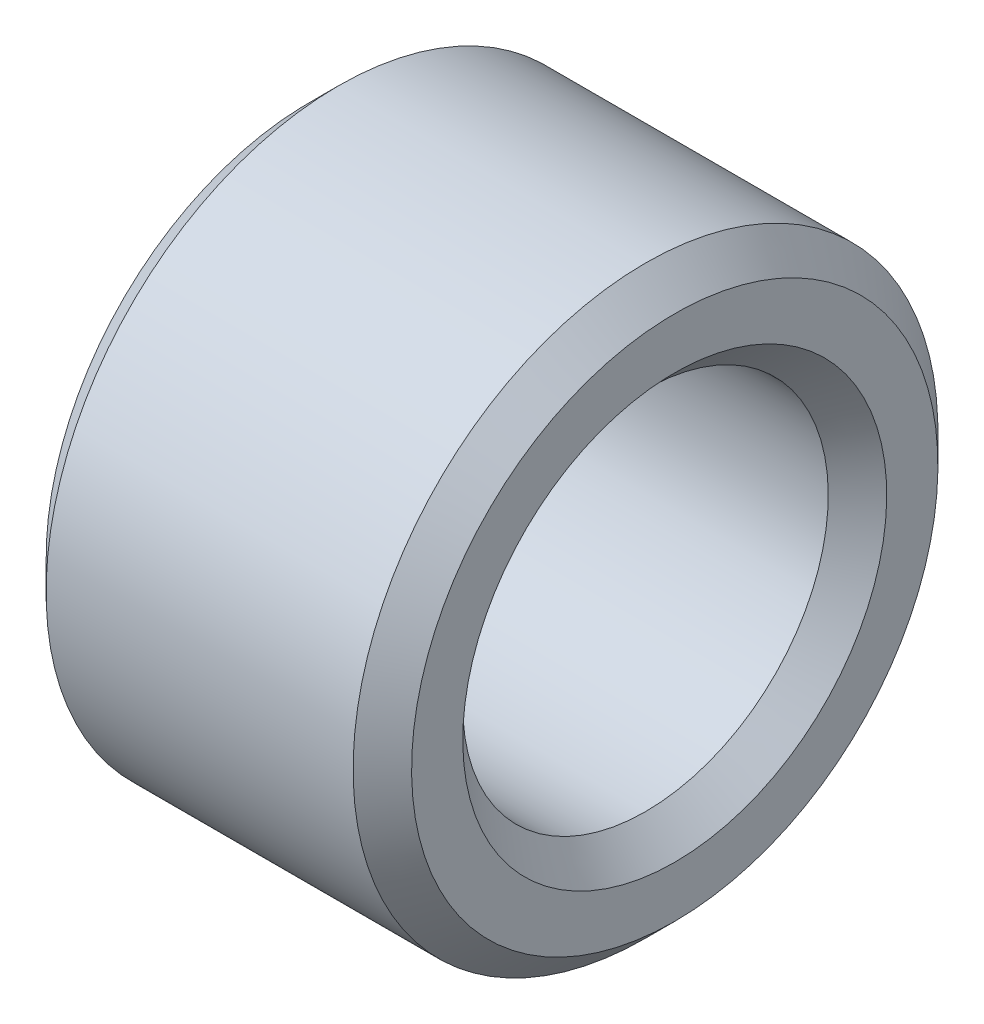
ISO-10303-21;
HEADER;
FILE_DESCRIPTION(('STEP AP214'),'2;1');
FILE_NAME('part.step','',(''),(''),'','','');
FILE_SCHEMA(('AUTOMOTIVE_DESIGN { 1 0 10303 214 1 1 1 1 }'));
ENDSEC;
DATA;
#1=APPLICATION_CONTEXT('core data for automotive mechanical design processes');
#2=APPLICATION_PROTOCOL_DEFINITION('international standard','automotive_design',2000,#1);
#3=PRODUCT_CONTEXT('',#1,'mechanical');
#4=PRODUCT('Part','Part','',(#3));
#5=PRODUCT_RELATED_PRODUCT_CATEGORY('part','',(#4));
#6=PRODUCT_DEFINITION_FORMATION('','',#4);
#7=PRODUCT_DEFINITION_CONTEXT('part definition',#1,'design');
#8=PRODUCT_DEFINITION('design','',#6,#7);
#9=PRODUCT_DEFINITION_SHAPE('','',#8);
#10=(LENGTH_UNIT() NAMED_UNIT(*) SI_UNIT(.MILLI.,.METRE.));
#11=(NAMED_UNIT(*) PLANE_ANGLE_UNIT() SI_UNIT($,.RADIAN.));
#12=(NAMED_UNIT(*) SI_UNIT($,.STERADIAN.) SOLID_ANGLE_UNIT());
#13=UNCERTAINTY_MEASURE_WITH_UNIT(LENGTH_MEASURE(1.E-05),#10,'distance_accuracy_value','');
#14=(GEOMETRIC_REPRESENTATION_CONTEXT(3) GLOBAL_UNCERTAINTY_ASSIGNED_CONTEXT((#13)) GLOBAL_UNIT_ASSIGNED_CONTEXT((#10,
#11,#12)) REPRESENTATION_CONTEXT('',''));
#15=CARTESIAN_POINT('',(0.,0.,0.));
#16=DIRECTION('',(0.,0.,1.));
#17=DIRECTION('',(1.,0.,0.));
#18=AXIS2_PLACEMENT_3D('',#15,#16,#17);
#19=CARTESIAN_POINT('',(0.,-3.25,0.));
#20=DIRECTION('',(-1.,0.,0.));
#21=DIRECTION('',(0.,1.,0.));
#22=AXIS2_PLACEMENT_3D('',#19,#20,#21);
#23=PLANE('',#22);
#24=CARTESIAN_POINT('',(0.,0.,0.));
#25=DIRECTION('',(1.,0.,0.));
#26=DIRECTION('',(0.,-1.,0.));
#27=AXIS2_PLACEMENT_3D('',#24,#25,#26);
#28=CIRCLE('',#27,2.9);
#29=CARTESIAN_POINT('',(0.,-2.9,0.));
#30=VERTEX_POINT('',#29);
#31=EDGE_CURVE('E9',#30,#30,#28,.T.);
#32=ORIENTED_EDGE('',*,*,#31,.T.);
#33=EDGE_LOOP('',(#32));
#34=FACE_BOUND('',#33,.T.);
#35=CARTESIAN_POINT('',(0.,0.,0.));
#36=DIRECTION('',(1.,0.,0.));
#37=DIRECTION('',(0.,-1.,0.));
#38=AXIS2_PLACEMENT_3D('',#35,#36,#37);
#39=CIRCLE('',#38,3.6);
#40=CARTESIAN_POINT('',(0.,-3.6,0.));
#41=VERTEX_POINT('',#40);
#42=EDGE_CURVE('E41',#41,#41,#39,.T.);
#43=ORIENTED_EDGE('',*,*,#42,.F.);
#44=EDGE_LOOP('',(#43));
#45=FACE_BOUND('',#44,.T.);
#46=ADVANCED_FACE('F15',(#34,#45),#23,.T.);
#47=CARTESIAN_POINT('',(0.2,0.,0.));
#48=DIRECTION('',(-1.,0.,0.));
#49=DIRECTION('',(0.,-1.,0.));
#50=AXIS2_PLACEMENT_3D('',#47,#48,#49);
#51=CONICAL_SURFACE('',#50,2.7,0.785398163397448);
#52=CARTESIAN_POINT('',(0.4,0.,0.));
#53=DIRECTION('',(1.,0.,0.));
#54=DIRECTION('',(0.,-1.,0.));
#55=AXIS2_PLACEMENT_3D('',#52,#53,#54);
#56=CIRCLE('',#55,2.5);
#57=CARTESIAN_POINT('',(0.4,-2.5,0.));
#58=VERTEX_POINT('',#57);
#59=EDGE_CURVE('E19',#58,#58,#56,.T.);
#60=ORIENTED_EDGE('',*,*,#59,.T.);
#61=EDGE_LOOP('',(#60));
#62=FACE_BOUND('',#61,.T.);
#63=ORIENTED_EDGE('',*,*,#31,.F.);
#64=EDGE_LOOP('',(#63));
#65=FACE_BOUND('',#64,.T.);
#66=ADVANCED_FACE('F73',(#62,#65),#51,.F.);
#67=CARTESIAN_POINT('',(2.5,0.,0.));
#68=DIRECTION('',(-1.,0.,0.));
#69=DIRECTION('',(0.,-1.,0.));
#70=AXIS2_PLACEMENT_3D('',#67,#68,#69);
#71=CYLINDRICAL_SURFACE('',#70,2.5);
#72=CARTESIAN_POINT('',(4.6,0.,0.));
#73=DIRECTION('',(1.,0.,0.));
#74=DIRECTION('',(0.,-1.,0.));
#75=AXIS2_PLACEMENT_3D('',#72,#73,#74);
#76=CIRCLE('',#75,2.5);
#77=CARTESIAN_POINT('',(4.6,-2.5,0.));
#78=VERTEX_POINT('',#77);
#79=EDGE_CURVE('E64',#78,#78,#76,.T.);
#80=ORIENTED_EDGE('',*,*,#79,.T.);
#81=EDGE_LOOP('',(#80));
#82=FACE_BOUND('',#81,.T.);
#83=ORIENTED_EDGE('',*,*,#59,.F.);
#84=EDGE_LOOP('',(#83));
#85=FACE_BOUND('',#84,.T.);
#86=ADVANCED_FACE('F17',(#82,#85),#71,.F.);
#87=CARTESIAN_POINT('',(4.8,0.,0.));
#88=DIRECTION('',(1.,0.,0.));
#89=DIRECTION('',(0.,-1.,0.));
#90=AXIS2_PLACEMENT_3D('',#87,#88,#89);
#91=CONICAL_SURFACE('',#90,2.7,0.785398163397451);
#92=CARTESIAN_POINT('',(5.,0.,0.));
#93=DIRECTION('',(1.,0.,0.));
#94=DIRECTION('',(0.,-1.,0.));
#95=AXIS2_PLACEMENT_3D('',#92,#93,#94);
#96=CIRCLE('',#95,2.9);
#97=CARTESIAN_POINT('',(5.,-2.9,0.));
#98=VERTEX_POINT('',#97);
#99=EDGE_CURVE('E53',#98,#98,#96,.T.);
#100=ORIENTED_EDGE('',*,*,#99,.T.);
#101=EDGE_LOOP('',(#100));
#102=FACE_BOUND('',#101,.T.);
#103=ORIENTED_EDGE('',*,*,#79,.F.);
#104=EDGE_LOOP('',(#103));
#105=FACE_BOUND('',#104,.T.);
#106=ADVANCED_FACE('F77',(#102,#105),#91,.F.);
#107=CARTESIAN_POINT('',(5.,-3.25,0.));
#108=DIRECTION('',(1.,0.,0.));
#109=DIRECTION('',(0.,-1.,0.));
#110=AXIS2_PLACEMENT_3D('',#107,#108,#109);
#111=PLANE('',#110);
#112=CARTESIAN_POINT('',(5.,0.,0.));
#113=DIRECTION('',(1.,0.,0.));
#114=DIRECTION('',(0.,-1.,0.));
#115=AXIS2_PLACEMENT_3D('',#112,#113,#114);
#116=CIRCLE('',#115,3.6);
#117=CARTESIAN_POINT('',(5.,-3.6,0.));
#118=VERTEX_POINT('',#117);
#119=EDGE_CURVE('E58',#118,#118,#116,.T.);
#120=ORIENTED_EDGE('',*,*,#119,.T.);
#121=EDGE_LOOP('',(#120));
#122=FACE_BOUND('',#121,.T.);
#123=ORIENTED_EDGE('',*,*,#99,.F.);
#124=EDGE_LOOP('',(#123));
#125=FACE_BOUND('',#124,.T.);
#126=ADVANCED_FACE('F59',(#122,#125),#111,.T.);
#127=CARTESIAN_POINT('',(4.8,0.,0.));
#128=DIRECTION('',(-1.,0.,0.));
#129=DIRECTION('',(0.,-1.,0.));
#130=AXIS2_PLACEMENT_3D('',#127,#128,#129);
#131=CONICAL_SURFACE('',#130,3.8,0.78539816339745);
#132=CARTESIAN_POINT('',(4.6,0.,0.));
#133=DIRECTION('',(1.,0.,0.));
#134=DIRECTION('',(0.,-1.,0.));
#135=AXIS2_PLACEMENT_3D('',#132,#133,#134);
#136=CIRCLE('',#135,4.);
#137=CARTESIAN_POINT('',(4.6,-4.,0.));
#138=VERTEX_POINT('',#137);
#139=EDGE_CURVE('E62',#138,#138,#136,.T.);
#140=ORIENTED_EDGE('',*,*,#139,.T.);
#141=EDGE_LOOP('',(#140));
#142=FACE_BOUND('',#141,.T.);
#143=ORIENTED_EDGE('',*,*,#119,.F.);
#144=EDGE_LOOP('',(#143));
#145=FACE_BOUND('',#144,.T.);
#146=ADVANCED_FACE('F90',(#142,#145),#131,.T.);
#147=CARTESIAN_POINT('',(2.5,0.,0.));
#148=DIRECTION('',(-1.,0.,0.));
#149=DIRECTION('',(0.,-1.,0.));
#150=AXIS2_PLACEMENT_3D('',#147,#148,#149);
#151=CYLINDRICAL_SURFACE('',#150,4.);
#152=CARTESIAN_POINT('',(0.4,0.,0.));
#153=DIRECTION('',(1.,0.,0.));
#154=DIRECTION('',(0.,-1.,0.));
#155=AXIS2_PLACEMENT_3D('',#152,#153,#154);
#156=CIRCLE('',#155,4.);
#157=CARTESIAN_POINT('',(0.4,-4.,0.));
#158=VERTEX_POINT('',#157);
#159=EDGE_CURVE('E47',#158,#158,#156,.T.);
#160=ORIENTED_EDGE('',*,*,#159,.T.);
#161=EDGE_LOOP('',(#160));
#162=FACE_BOUND('',#161,.T.);
#163=ORIENTED_EDGE('',*,*,#139,.F.);
#164=EDGE_LOOP('',(#163));
#165=FACE_BOUND('',#164,.T.);
#166=ADVANCED_FACE('F93',(#162,#165),#151,.T.);
#167=CARTESIAN_POINT('',(0.2,0.,0.));
#168=DIRECTION('',(1.,0.,0.));
#169=DIRECTION('',(0.,-1.,0.));
#170=AXIS2_PLACEMENT_3D('',#167,#168,#169);
#171=CONICAL_SURFACE('',#170,3.8,0.785398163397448);
#172=ORIENTED_EDGE('',*,*,#42,.T.);
#173=EDGE_LOOP('',(#172));
#174=FACE_BOUND('',#173,.T.);
#175=ORIENTED_EDGE('',*,*,#159,.F.);
#176=EDGE_LOOP('',(#175));
#177=FACE_BOUND('',#176,.T.);
#178=ADVANCED_FACE('F96',(#174,#177),#171,.T.);
#179=CLOSED_SHELL('',(#46,#66,#86,#106,#126,#146,#166,#178));
#180=MANIFOLD_SOLID_BREP('B1',#179);
#181=ADVANCED_BREP_SHAPE_REPRESENTATION('',(#18,#180),#14);
#182=SHAPE_DEFINITION_REPRESENTATION(#9,#181);
ENDSEC;
END-ISO-10303-21;
